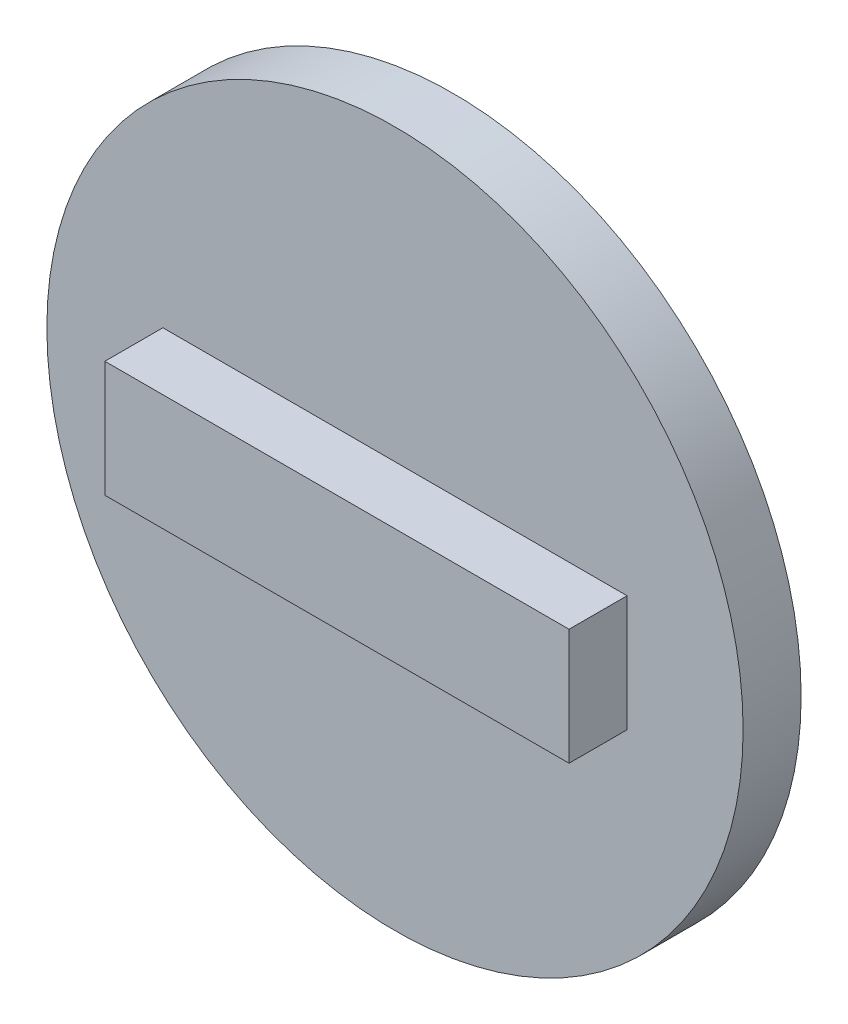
from build123d import *

# Parameters (mm, degrees)
SKETCH1_R      = 19.05
EXTRUDE1_DEPTH = 3.175
SKETCH2_W      = 25.4
SKETCH2_H      = 6.35
EXTRUDE2_DEPTH = 3.175


with BuildPart() as part:
    # Sketch1 → Extrude1 (new body)
    with BuildSketch(Plane.XY):
        Circle(SKETCH1_R)
    extrude(amount=EXTRUDE1_DEPTH)

    # Sketch2 → Extrude2 (add)
    with BuildSketch(Plane.XY.offset(3.175)):
        Rectangle(SKETCH2_W, SKETCH2_H)
    extrude(amount=EXTRUDE2_DEPTH)


solid = part.part
